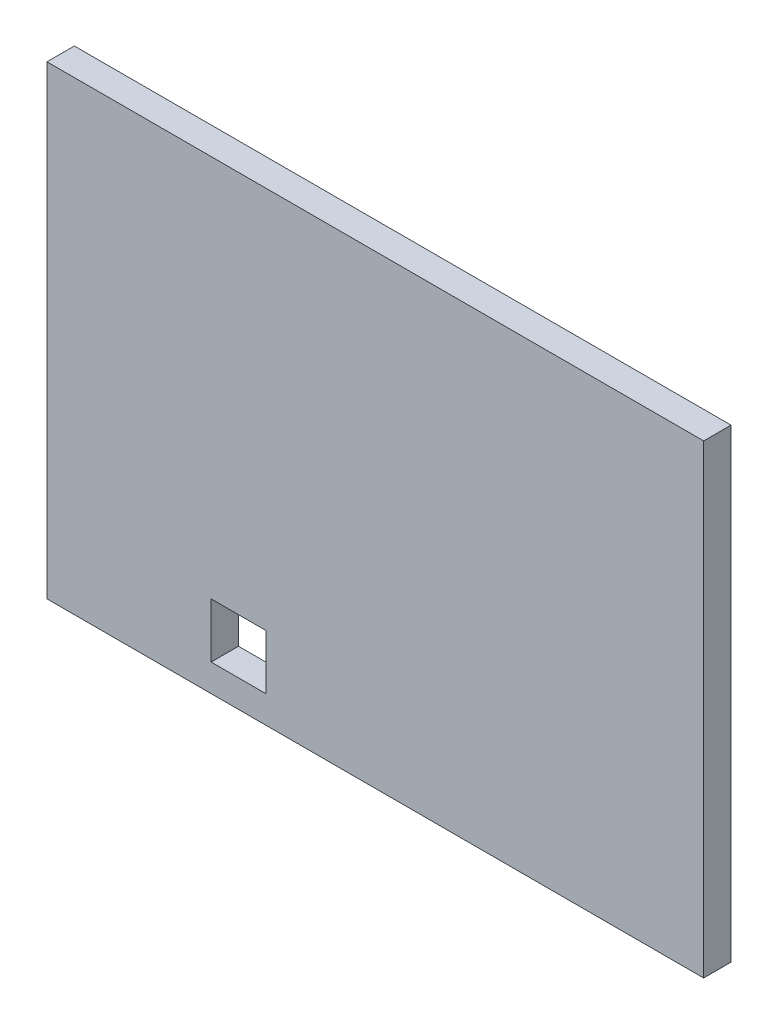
from build123d import *

# Parameters (mm, degrees)
SKETCH_1_W          = 120
SKETCH_1_H          = 85
EXTRUDE_1_DEPTH     = 5
SKETCH_3_W          = 10
SKETCH_3_H          = 10
CUT_EXTRUDE_1_DEPTH = 10


with BuildPart() as part:
    # Sketch 1 → Extrude 1 (new body)
    with BuildSketch(Plane.XY):
        Rectangle(SKETCH_1_W, SKETCH_1_H)
    extrude(amount=EXTRUDE_1_DEPTH)

    # Sketch 3 → Cut-Extrude 1 (cut)
    with BuildSketch(Plane.XY.offset(5)):
        with Locations((-25, -32.5)):
            Rectangle(SKETCH_3_W, SKETCH_3_H)
    extrude(amount=-CUT_EXTRUDE_1_DEPTH, mode=Mode.SUBTRACT)


solid = part.part
